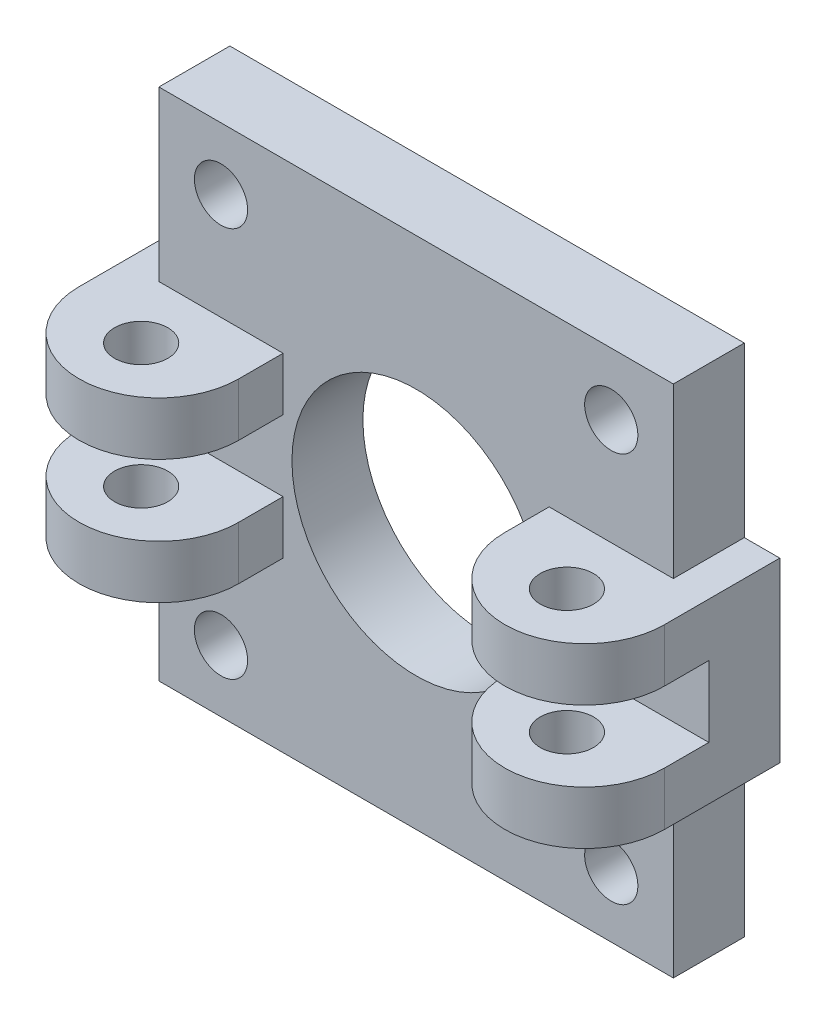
ISO-10303-21;
HEADER;
FILE_DESCRIPTION(('STEP AP214'),'2;1');
FILE_NAME('part.step','',(''),(''),'','','');
FILE_SCHEMA(('AUTOMOTIVE_DESIGN { 1 0 10303 214 1 1 1 1 }'));
ENDSEC;
DATA;
#1=APPLICATION_CONTEXT('core data for automotive mechanical design processes');
#2=APPLICATION_PROTOCOL_DEFINITION('international standard','automotive_design',2000,#1);
#3=PRODUCT_CONTEXT('',#1,'mechanical');
#4=PRODUCT('Part','Part','',(#3));
#5=PRODUCT_RELATED_PRODUCT_CATEGORY('part','',(#4));
#6=PRODUCT_DEFINITION_FORMATION('','',#4);
#7=PRODUCT_DEFINITION_CONTEXT('part definition',#1,'design');
#8=PRODUCT_DEFINITION('design','',#6,#7);
#9=PRODUCT_DEFINITION_SHAPE('','',#8);
#10=(LENGTH_UNIT() NAMED_UNIT(*) SI_UNIT(.MILLI.,.METRE.));
#11=(NAMED_UNIT(*) PLANE_ANGLE_UNIT() SI_UNIT($,.RADIAN.));
#12=(NAMED_UNIT(*) SI_UNIT($,.STERADIAN.) SOLID_ANGLE_UNIT());
#13=UNCERTAINTY_MEASURE_WITH_UNIT(LENGTH_MEASURE(1.E-05),#10,'distance_accuracy_value','');
#14=(GEOMETRIC_REPRESENTATION_CONTEXT(3) GLOBAL_UNCERTAINTY_ASSIGNED_CONTEXT((#13)) GLOBAL_UNIT_ASSIGNED_CONTEXT((#10,
#11,#12)) REPRESENTATION_CONTEXT('',''));
#15=CARTESIAN_POINT('',(0.,0.,0.));
#16=DIRECTION('',(0.,0.,1.));
#17=DIRECTION('',(1.,0.,0.));
#18=AXIS2_PLACEMENT_3D('',#15,#16,#17);
#19=CARTESIAN_POINT('',(-0.123161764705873,-0.224264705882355,-13.4536240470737));
#20=DIRECTION('',(1.,0.,0.));
#21=DIRECTION('',(0.,1.,0.));
#22=AXIS2_PLACEMENT_3D('',#19,#20,#21);
#23=PLANE('',#22);
#24=DIRECTION('',(0.,1.,0.));
#25=VECTOR('',#24,1.);
#26=CARTESIAN_POINT('',(-0.123161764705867,-16.5882257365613,6.5));
#27=LINE('',#26,#25);
#28=CARTESIAN_POINT('',(-0.123161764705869,-10.2242647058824,6.5));
#29=VERTEX_POINT('',#28);
#30=CARTESIAN_POINT('',(-0.123161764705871,-7.22426470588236,6.5));
#31=VERTEX_POINT('',#30);
#32=EDGE_CURVE('E287',#29,#31,#27,.T.);
#33=ORIENTED_EDGE('',*,*,#32,.T.);
#34=DIRECTION('',(0.,0.,1.));
#35=VECTOR('',#34,1.);
#36=CARTESIAN_POINT('',(-0.123161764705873,-7.22426470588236,4.));
#37=LINE('',#36,#35);
#38=CARTESIAN_POINT('',(-0.123161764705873,-7.22426470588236,4.));
#39=VERTEX_POINT('',#38);
#40=EDGE_CURVE('E491',#39,#31,#37,.T.);
#41=ORIENTED_EDGE('',*,*,#40,.F.);
#42=DIRECTION('',(0.,1.,0.));
#43=VECTOR('',#42,1.);
#44=CARTESIAN_POINT('',(-0.123161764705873,0.,4.));
#45=LINE('',#44,#43);
#46=CARTESIAN_POINT('',(-0.123161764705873,-10.2242647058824,4.));
#47=VERTEX_POINT('',#46);
#48=EDGE_CURVE('E307',#47,#39,#45,.T.);
#49=ORIENTED_EDGE('',*,*,#48,.F.);
#50=DIRECTION('',(0.,0.,1.));
#51=VECTOR('',#50,1.);
#52=CARTESIAN_POINT('',(-0.123161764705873,-10.2242647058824,-13.4536240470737));
#53=LINE('',#52,#51);
#54=EDGE_CURVE('E304',#47,#29,#53,.T.);
#55=ORIENTED_EDGE('',*,*,#54,.T.);
#56=EDGE_LOOP('',(#33,#41,#49,#55));
#57=FACE_BOUND('',#56,.T.);
#58=ADVANCED_FACE('F107',(#57),#23,.F.);
#59=CARTESIAN_POINT('',(-0.123161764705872,-3.22426470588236,6.5));
#60=VERTEX_POINT('',#59);
#61=CARTESIAN_POINT('',(-0.123161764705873,-0.224264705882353,6.5));
#62=VERTEX_POINT('',#61);
#63=EDGE_CURVE('E272',#60,#62,#27,.T.);
#64=ORIENTED_EDGE('',*,*,#63,.T.);
#65=DIRECTION('',(0.,0.,1.));
#66=VECTOR('',#65,1.);
#67=CARTESIAN_POINT('',(-0.123161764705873,-0.224264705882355,-13.4536240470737));
#68=LINE('',#67,#66);
#69=CARTESIAN_POINT('',(-0.123161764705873,-0.224264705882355,4.));
#70=VERTEX_POINT('',#69);
#71=EDGE_CURVE('E284',#70,#62,#68,.T.);
#72=ORIENTED_EDGE('',*,*,#71,.F.);
#73=CARTESIAN_POINT('',(-0.123161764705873,-3.22426470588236,4.));
#74=VERTEX_POINT('',#73);
#75=EDGE_CURVE('E129',#74,#70,#45,.T.);
#76=ORIENTED_EDGE('',*,*,#75,.F.);
#77=DIRECTION('',(0.,0.,1.));
#78=VECTOR('',#77,1.);
#79=CARTESIAN_POINT('',(-0.123161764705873,-3.22426470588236,4.));
#80=LINE('',#79,#78);
#81=EDGE_CURVE('E286',#74,#60,#80,.T.);
#82=ORIENTED_EDGE('',*,*,#81,.T.);
#83=EDGE_LOOP('',(#64,#72,#76,#82));
#84=FACE_BOUND('',#83,.T.);
#85=ADVANCED_FACE('F283',(#84),#23,.F.);
#86=CARTESIAN_POINT('',(8.87683823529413,-10.2242647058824,-13.4536240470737));
#87=DIRECTION('',(0.,1.,0.));
#88=DIRECTION('',(-1.,0.,0.));
#89=AXIS2_PLACEMENT_3D('',#86,#87,#88);
#90=PLANE('',#89);
#91=CARTESIAN_POINT('',(4.37683823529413,-10.2242647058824,7.5));
#92=DIRECTION('',(0.,-1.,0.));
#93=DIRECTION('',(1.,0.,0.));
#94=AXIS2_PLACEMENT_3D('',#91,#92,#93);
#95=CIRCLE('',#94,1.5);
#96=CARTESIAN_POINT('',(5.87683823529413,-10.2242647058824,7.5));
#97=VERTEX_POINT('',#96);
#98=EDGE_CURVE('E469',#97,#97,#95,.T.);
#99=ORIENTED_EDGE('',*,*,#98,.F.);
#100=EDGE_LOOP('',(#99));
#101=FACE_BOUND('',#100,.T.);
#102=CARTESIAN_POINT('',(4.37683823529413,-10.2242647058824,6.5));
#103=DIRECTION('',(0.,-1.,0.));
#104=DIRECTION('',(1.,0.,0.));
#105=AXIS2_PLACEMENT_3D('',#102,#103,#104);
#106=CIRCLE('',#105,4.5);
#107=CARTESIAN_POINT('',(8.87683823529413,-10.2242647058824,6.5));
#108=VERTEX_POINT('',#107);
#109=EDGE_CURVE('E570',#108,#29,#106,.T.);
#110=ORIENTED_EDGE('',*,*,#109,.T.);
#111=ORIENTED_EDGE('',*,*,#54,.F.);
#112=DIRECTION('',(-1.,0.,0.));
#113=VECTOR('',#112,1.);
#114=CARTESIAN_POINT('',(0.,-10.2242647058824,4.));
#115=LINE('',#114,#113);
#116=CARTESIAN_POINT('',(6.87683823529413,-10.2242647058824,4.));
#117=VERTEX_POINT('',#116);
#118=EDGE_CURVE('E314',#117,#47,#115,.T.);
#119=ORIENTED_EDGE('',*,*,#118,.F.);
#120=DIRECTION('',(0.,0.,1.));
#121=VECTOR('',#120,1.);
#122=CARTESIAN_POINT('',(6.87683823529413,-10.2242647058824,4.));
#123=LINE('',#122,#121);
#124=CARTESIAN_POINT('',(6.87683823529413,-10.2242647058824,0.));
#125=VERTEX_POINT('',#124);
#126=EDGE_CURVE('E317',#125,#117,#123,.T.);
#127=ORIENTED_EDGE('',*,*,#126,.F.);
#128=DIRECTION('',(1.,0.,0.));
#129=VECTOR('',#128,1.);
#130=CARTESIAN_POINT('',(8.87683823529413,-10.2242647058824,0.));
#131=LINE('',#130,#129);
#132=CARTESIAN_POINT('',(8.87683823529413,-10.2242647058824,0.));
#133=VERTEX_POINT('',#132);
#134=EDGE_CURVE('E291',#125,#133,#131,.T.);
#135=ORIENTED_EDGE('',*,*,#134,.T.);
#136=DIRECTION('',(0.,0.,1.));
#137=VECTOR('',#136,1.);
#138=CARTESIAN_POINT('',(8.87683823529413,-10.2242647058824,-13.4536240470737));
#139=LINE('',#138,#137);
#140=EDGE_CURVE('E296',#133,#108,#139,.T.);
#141=ORIENTED_EDGE('',*,*,#140,.T.);
#142=EDGE_LOOP('',(#110,#111,#119,#127,#135,#141));
#143=FACE_BOUND('',#142,.T.);
#144=ADVANCED_FACE('F567',(#101,#143),#90,.F.);
#145=CARTESIAN_POINT('',(8.87683823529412,-0.224264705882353,-13.4536240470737));
#146=DIRECTION('',(0.,-1.,0.));
#147=DIRECTION('',(1.,0.,0.));
#148=AXIS2_PLACEMENT_3D('',#145,#146,#147);
#149=PLANE('',#148);
#150=CARTESIAN_POINT('',(4.37683823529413,-0.224264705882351,7.5));
#151=DIRECTION('',(0.,-1.,0.));
#152=DIRECTION('',(1.,0.,0.));
#153=AXIS2_PLACEMENT_3D('',#150,#151,#152);
#154=CIRCLE('',#153,1.5);
#155=CARTESIAN_POINT('',(5.87683823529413,-0.22426470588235,7.5));
#156=VERTEX_POINT('',#155);
#157=EDGE_CURVE('E280',#156,#156,#154,.T.);
#158=ORIENTED_EDGE('',*,*,#157,.T.);
#159=EDGE_LOOP('',(#158));
#160=FACE_BOUND('',#159,.T.);
#161=ORIENTED_EDGE('',*,*,#71,.T.);
#162=CARTESIAN_POINT('',(4.37683823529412,-0.224264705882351,6.5));
#163=DIRECTION('',(0.,-1.,0.));
#164=DIRECTION('',(1.,0.,0.));
#165=AXIS2_PLACEMENT_3D('',#162,#163,#164);
#166=CIRCLE('',#165,4.5);
#167=CARTESIAN_POINT('',(8.87683823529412,-0.224264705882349,6.5));
#168=VERTEX_POINT('',#167);
#169=EDGE_CURVE('E269',#168,#62,#166,.T.);
#170=ORIENTED_EDGE('',*,*,#169,.F.);
#171=DIRECTION('',(0.,0.,1.));
#172=VECTOR('',#171,1.);
#173=CARTESIAN_POINT('',(8.87683823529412,-0.224264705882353,-13.4536240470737));
#174=LINE('',#173,#172);
#175=CARTESIAN_POINT('',(8.87683823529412,-0.224264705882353,0.));
#176=VERTEX_POINT('',#175);
#177=EDGE_CURVE('E292',#176,#168,#174,.T.);
#178=ORIENTED_EDGE('',*,*,#177,.F.);
#179=DIRECTION('',(-1.,0.,0.));
#180=VECTOR('',#179,1.);
#181=CARTESIAN_POINT('',(8.87683823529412,-0.224264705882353,0.));
#182=LINE('',#181,#180);
#183=CARTESIAN_POINT('',(6.87683823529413,-0.224264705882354,0.));
#184=VERTEX_POINT('',#183);
#185=EDGE_CURVE('E299',#176,#184,#182,.T.);
#186=ORIENTED_EDGE('',*,*,#185,.T.);
#187=DIRECTION('',(0.,0.,-1.));
#188=VECTOR('',#187,1.);
#189=CARTESIAN_POINT('',(6.87683823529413,-0.224264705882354,4.));
#190=LINE('',#189,#188);
#191=CARTESIAN_POINT('',(6.87683823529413,-0.224264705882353,4.));
#192=VERTEX_POINT('',#191);
#193=EDGE_CURVE('E311',#192,#184,#190,.T.);
#194=ORIENTED_EDGE('',*,*,#193,.F.);
#195=DIRECTION('',(1.,0.,0.));
#196=VECTOR('',#195,1.);
#197=CARTESIAN_POINT('',(0.,-0.224264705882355,4.));
#198=LINE('',#197,#196);
#199=EDGE_CURVE('E290',#70,#192,#198,.T.);
#200=ORIENTED_EDGE('',*,*,#199,.F.);
#201=EDGE_LOOP('',(#161,#170,#178,#186,#194,#200));
#202=FACE_BOUND('',#201,.T.);
#203=ADVANCED_FACE('F289',(#160,#202),#149,.F.);
#204=CARTESIAN_POINT('',(-15.2463235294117,-3.22426470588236,4.));
#205=DIRECTION('',(0.,1.,0.));
#206=DIRECTION('',(-1.,0.,0.));
#207=AXIS2_PLACEMENT_3D('',#204,#205,#206);
#208=PLANE('',#207);
#209=CARTESIAN_POINT('',(4.37683823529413,-3.22426470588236,7.5));
#210=DIRECTION('',(0.,1.,0.));
#211=DIRECTION('',(-1.,0.,0.));
#212=AXIS2_PLACEMENT_3D('',#209,#210,#211);
#213=CIRCLE('',#212,1.5);
#214=CARTESIAN_POINT('',(2.87683823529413,-3.22426470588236,7.5));
#215=VERTEX_POINT('',#214);
#216=EDGE_CURVE('E468',#215,#215,#213,.F.);
#217=ORIENTED_EDGE('',*,*,#216,.F.);
#218=EDGE_LOOP('',(#217));
#219=FACE_BOUND('',#218,.T.);
#220=CARTESIAN_POINT('',(4.37683823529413,-3.22426470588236,6.5));
#221=DIRECTION('',(0.,1.,0.));
#222=DIRECTION('',(-1.,0.,0.));
#223=AXIS2_PLACEMENT_3D('',#220,#221,#222);
#224=CIRCLE('',#223,4.5);
#225=CARTESIAN_POINT('',(8.87683823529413,-3.22426470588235,6.5));
#226=VERTEX_POINT('',#225);
#227=EDGE_CURVE('E473',#226,#60,#224,.F.);
#228=ORIENTED_EDGE('',*,*,#227,.T.);
#229=ORIENTED_EDGE('',*,*,#81,.F.);
#230=DIRECTION('',(-1.,0.,0.));
#231=VECTOR('',#230,1.);
#232=CARTESIAN_POINT('',(-15.2463235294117,-3.22426470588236,4.));
#233=LINE('',#232,#231);
#234=CARTESIAN_POINT('',(8.87683823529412,-3.22426470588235,4.));
#235=VERTEX_POINT('',#234);
#236=EDGE_CURVE('E489',#235,#74,#233,.T.);
#237=ORIENTED_EDGE('',*,*,#236,.F.);
#238=DIRECTION('',(0.,0.,1.));
#239=VECTOR('',#238,1.);
#240=CARTESIAN_POINT('',(8.87683823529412,-3.22426470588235,4.));
#241=LINE('',#240,#239);
#242=EDGE_CURVE('E493',#235,#226,#241,.T.);
#243=ORIENTED_EDGE('',*,*,#242,.T.);
#244=EDGE_LOOP('',(#228,#229,#237,#243));
#245=FACE_BOUND('',#244,.T.);
#246=ADVANCED_FACE('F582',(#219,#245),#208,.F.);
#247=CARTESIAN_POINT('',(-15.2463235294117,-7.22426470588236,4.));
#248=DIRECTION('',(0.,1.,0.));
#249=DIRECTION('',(-1.,0.,0.));
#250=AXIS2_PLACEMENT_3D('',#247,#248,#249);
#251=PLANE('',#250);
#252=ORIENTED_EDGE('',*,*,#40,.T.);
#253=CARTESIAN_POINT('',(4.37683823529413,-7.22426470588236,6.5));
#254=DIRECTION('',(0.,1.,0.));
#255=DIRECTION('',(-1.,0.,0.));
#256=AXIS2_PLACEMENT_3D('',#253,#254,#255);
#257=CIRCLE('',#256,4.5);
#258=CARTESIAN_POINT('',(8.87683823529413,-7.22426470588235,6.5));
#259=VERTEX_POINT('',#258);
#260=EDGE_CURVE('E12',#259,#31,#257,.F.);
#261=ORIENTED_EDGE('',*,*,#260,.F.);
#262=DIRECTION('',(0.,0.,1.));
#263=VECTOR('',#262,1.);
#264=CARTESIAN_POINT('',(8.87683823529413,-7.22426470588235,4.));
#265=LINE('',#264,#263);
#266=CARTESIAN_POINT('',(8.87683823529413,-7.22426470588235,4.));
#267=VERTEX_POINT('',#266);
#268=EDGE_CURVE('E496',#267,#259,#265,.T.);
#269=ORIENTED_EDGE('',*,*,#268,.F.);
#270=DIRECTION('',(-1.,0.,0.));
#271=VECTOR('',#270,1.);
#272=CARTESIAN_POINT('',(-15.2463235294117,-7.22426470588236,4.));
#273=LINE('',#272,#271);
#274=EDGE_CURVE('E484',#267,#39,#273,.T.);
#275=ORIENTED_EDGE('',*,*,#274,.T.);
#276=EDGE_LOOP('',(#252,#261,#269,#275));
#277=FACE_BOUND('',#276,.T.);
#278=CARTESIAN_POINT('',(4.37683823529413,-7.22426470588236,7.5));
#279=DIRECTION('',(0.,1.,0.));
#280=DIRECTION('',(-1.,0.,0.));
#281=AXIS2_PLACEMENT_3D('',#278,#279,#280);
#282=CIRCLE('',#281,1.5);
#283=CARTESIAN_POINT('',(2.87683823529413,-7.22426470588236,7.5));
#284=VERTEX_POINT('',#283);
#285=EDGE_CURVE('E466',#284,#284,#282,.F.);
#286=ORIENTED_EDGE('',*,*,#285,.T.);
#287=EDGE_LOOP('',(#286));
#288=FACE_BOUND('',#287,.T.);
#289=ADVANCED_FACE('F584',(#277,#288),#251,.T.);
#290=CARTESIAN_POINT('',(6.87683823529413,0.,4.));
#291=DIRECTION('',(1.,0.,0.));
#292=DIRECTION('',(0.,1.,0.));
#293=AXIS2_PLACEMENT_3D('',#290,#291,#292);
#294=PLANE('',#293);
#295=DIRECTION('',(0.,-1.,0.));
#296=VECTOR('',#295,1.);
#297=CARTESIAN_POINT('',(6.87683823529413,0.,0.));
#298=LINE('',#297,#296);
#299=CARTESIAN_POINT('',(6.87683823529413,-19.7242647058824,0.));
#300=VERTEX_POINT('',#299);
#301=EDGE_CURVE('E431',#125,#300,#298,.T.);
#302=ORIENTED_EDGE('',*,*,#301,.F.);
#303=ORIENTED_EDGE('',*,*,#126,.T.);
#304=DIRECTION('',(0.,-1.,0.));
#305=VECTOR('',#304,1.);
#306=CARTESIAN_POINT('',(6.87683823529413,0.,4.));
#307=LINE('',#306,#305);
#308=CARTESIAN_POINT('',(6.87683823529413,-19.7242647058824,4.));
#309=VERTEX_POINT('',#308);
#310=EDGE_CURVE('E414',#117,#309,#307,.T.);
#311=ORIENTED_EDGE('',*,*,#310,.T.);
#312=DIRECTION('',(0.,0.,-1.));
#313=VECTOR('',#312,1.);
#314=CARTESIAN_POINT('',(6.87683823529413,-19.7242647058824,4.));
#315=LINE('',#314,#313);
#316=EDGE_CURVE('E426',#309,#300,#315,.T.);
#317=ORIENTED_EDGE('',*,*,#316,.T.);
#318=EDGE_LOOP('',(#302,#303,#311,#317));
#319=FACE_BOUND('',#318,.T.);
#320=ADVANCED_FACE('F109',(#319),#294,.T.);
#321=CARTESIAN_POINT('',(6.87683823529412,9.27573529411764,4.));
#322=VERTEX_POINT('',#321);
#323=EDGE_CURVE('E410',#322,#192,#307,.T.);
#324=ORIENTED_EDGE('',*,*,#323,.T.);
#325=ORIENTED_EDGE('',*,*,#193,.T.);
#326=CARTESIAN_POINT('',(6.87683823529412,9.27573529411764,0.));
#327=VERTEX_POINT('',#326);
#328=EDGE_CURVE('E427',#327,#184,#298,.T.);
#329=ORIENTED_EDGE('',*,*,#328,.F.);
#330=DIRECTION('',(0.,0.,-1.));
#331=VECTOR('',#330,1.);
#332=CARTESIAN_POINT('',(6.87683823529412,9.27573529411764,4.));
#333=LINE('',#332,#331);
#334=EDGE_CURVE('E450',#322,#327,#333,.T.);
#335=ORIENTED_EDGE('',*,*,#334,.F.);
#336=EDGE_LOOP('',(#324,#325,#329,#335));
#337=FACE_BOUND('',#336,.T.);
#338=ADVANCED_FACE('F507',(#337),#294,.T.);
#339=CARTESIAN_POINT('',(0.,0.,4.));
#340=DIRECTION('',(0.,0.,1.));
#341=DIRECTION('',(1.,0.,0.));
#342=AXIS2_PLACEMENT_3D('',#339,#340,#341);
#343=PLANE('',#342);
#344=CARTESIAN_POINT('',(-18.6231617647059,-16.2242647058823,4.));
#345=DIRECTION('',(0.,0.,1.));
#346=DIRECTION('',(1.,0.,0.));
#347=AXIS2_PLACEMENT_3D('',#344,#345,#346);
#348=CIRCLE('',#347,1.5);
#349=CARTESIAN_POINT('',(-17.1231617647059,-16.2242647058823,4.));
#350=VERTEX_POINT('',#349);
#351=EDGE_CURVE('E397',#350,#350,#348,.T.);
#352=ORIENTED_EDGE('',*,*,#351,.F.);
#353=EDGE_LOOP('',(#352));
#354=FACE_BOUND('',#353,.T.);
#355=CARTESIAN_POINT('',(3.37683823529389,-16.2242647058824,4.));
#356=DIRECTION('',(0.,0.,1.));
#357=DIRECTION('',(1.,0.,0.));
#358=AXIS2_PLACEMENT_3D('',#355,#356,#357);
#359=CIRCLE('',#358,1.5);
#360=CARTESIAN_POINT('',(4.87683823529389,-16.2242647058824,4.));
#361=VERTEX_POINT('',#360);
#362=EDGE_CURVE('E402',#361,#361,#359,.T.);
#363=ORIENTED_EDGE('',*,*,#362,.F.);
#364=EDGE_LOOP('',(#363));
#365=FACE_BOUND('',#364,.T.);
#366=CARTESIAN_POINT('',(3.376838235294,5.77573529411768,4.));
#367=DIRECTION('',(0.,0.,1.));
#368=DIRECTION('',(1.,0.,0.));
#369=AXIS2_PLACEMENT_3D('',#366,#367,#368);
#370=CIRCLE('',#369,1.5);
#371=CARTESIAN_POINT('',(4.876838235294,5.77573529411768,4.));
#372=VERTEX_POINT('',#371);
#373=EDGE_CURVE('E398',#372,#372,#370,.T.);
#374=ORIENTED_EDGE('',*,*,#373,.F.);
#375=EDGE_LOOP('',(#374));
#376=FACE_BOUND('',#375,.T.);
#377=CARTESIAN_POINT('',(-18.6231617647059,5.77573529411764,4.));
#378=DIRECTION('',(0.,0.,1.));
#379=DIRECTION('',(1.,0.,0.));
#380=AXIS2_PLACEMENT_3D('',#377,#378,#379);
#381=CIRCLE('',#380,1.5);
#382=CARTESIAN_POINT('',(-17.1231617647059,5.77573529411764,4.));
#383=VERTEX_POINT('',#382);
#384=EDGE_CURVE('E401',#383,#383,#381,.T.);
#385=ORIENTED_EDGE('',*,*,#384,.F.);
#386=EDGE_LOOP('',(#385));
#387=FACE_BOUND('',#386,.T.);
#388=CARTESIAN_POINT('',(-7.62316176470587,-5.22426470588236,4.));
#389=DIRECTION('',(0.,0.,1.));
#390=DIRECTION('',(1.,0.,0.));
#391=AXIS2_PLACEMENT_3D('',#388,#389,#390);
#392=CIRCLE('',#391,7.);
#393=CARTESIAN_POINT('',(-0.623161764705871,-5.22426470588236,4.));
#394=VERTEX_POINT('',#393);
#395=EDGE_CURVE('E423',#394,#394,#392,.T.);
#396=ORIENTED_EDGE('',*,*,#395,.F.);
#397=EDGE_LOOP('',(#396));
#398=FACE_BOUND('',#397,.T.);
#399=ORIENTED_EDGE('',*,*,#310,.F.);
#400=ORIENTED_EDGE('',*,*,#118,.T.);
#401=ORIENTED_EDGE('',*,*,#48,.T.);
#402=ORIENTED_EDGE('',*,*,#274,.F.);
#403=DIRECTION('',(0.,-1.,0.));
#404=VECTOR('',#403,1.);
#405=CARTESIAN_POINT('',(8.87683823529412,0.,4.));
#406=LINE('',#405,#404);
#407=EDGE_CURVE('E486',#235,#267,#406,.T.);
#408=ORIENTED_EDGE('',*,*,#407,.F.);
#409=ORIENTED_EDGE('',*,*,#236,.T.);
#410=ORIENTED_EDGE('',*,*,#75,.T.);
#411=ORIENTED_EDGE('',*,*,#199,.T.);
#412=ORIENTED_EDGE('',*,*,#323,.F.);
#413=DIRECTION('',(1.,0.,0.));
#414=VECTOR('',#413,1.);
#415=CARTESIAN_POINT('',(0.,9.27573529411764,4.));
#416=LINE('',#415,#414);
#417=CARTESIAN_POINT('',(-22.1231617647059,9.27573529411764,4.));
#418=VERTEX_POINT('',#417);
#419=EDGE_CURVE('E413',#418,#322,#416,.T.);
#420=ORIENTED_EDGE('',*,*,#419,.F.);
#421=DIRECTION('',(0.,-1.,0.));
#422=VECTOR('',#421,1.);
#423=CARTESIAN_POINT('',(-22.1231617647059,0.,4.));
#424=LINE('',#423,#422);
#425=CARTESIAN_POINT('',(-22.1231617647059,-0.224264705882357,4.));
#426=VERTEX_POINT('',#425);
#427=EDGE_CURVE('E418',#418,#426,#424,.T.);
#428=ORIENTED_EDGE('',*,*,#427,.T.);
#429=DIRECTION('',(-1.,0.,0.));
#430=VECTOR('',#429,1.);
#431=CARTESIAN_POINT('',(0.,-0.224264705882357,4.));
#432=LINE('',#431,#430);
#433=CARTESIAN_POINT('',(-15.1231617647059,-0.224264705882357,4.));
#434=VERTEX_POINT('',#433);
#435=EDGE_CURVE('E382',#434,#426,#432,.T.);
#436=ORIENTED_EDGE('',*,*,#435,.F.);
#437=DIRECTION('',(0.,1.,0.));
#438=VECTOR('',#437,1.);
#439=CARTESIAN_POINT('',(-15.1231617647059,0.,4.));
#440=LINE('',#439,#438);
#441=CARTESIAN_POINT('',(-15.1231617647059,-3.22426470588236,4.));
#442=VERTEX_POINT('',#441);
#443=EDGE_CURVE('E393',#442,#434,#440,.T.);
#444=ORIENTED_EDGE('',*,*,#443,.F.);
#445=DIRECTION('',(1.,0.,0.));
#446=VECTOR('',#445,1.);
#447=CARTESIAN_POINT('',(0.,-3.22426470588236,4.));
#448=LINE('',#447,#446);
#449=CARTESIAN_POINT('',(-24.1231617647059,-3.22426470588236,4.));
#450=VERTEX_POINT('',#449);
#451=EDGE_CURVE('E344',#450,#442,#448,.T.);
#452=ORIENTED_EDGE('',*,*,#451,.F.);
#453=DIRECTION('',(0.,-1.,0.));
#454=VECTOR('',#453,1.);
#455=CARTESIAN_POINT('',(-24.1231617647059,0.,4.));
#456=LINE('',#455,#454);
#457=CARTESIAN_POINT('',(-24.1231617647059,-7.22426470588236,4.));
#458=VERTEX_POINT('',#457);
#459=EDGE_CURVE('E346',#450,#458,#456,.T.);
#460=ORIENTED_EDGE('',*,*,#459,.T.);
#461=DIRECTION('',(1.,0.,0.));
#462=VECTOR('',#461,1.);
#463=CARTESIAN_POINT('',(0.,-7.22426470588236,4.));
#464=LINE('',#463,#462);
#465=CARTESIAN_POINT('',(-15.1231617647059,-7.22426470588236,4.));
#466=VERTEX_POINT('',#465);
#467=EDGE_CURVE('E348',#458,#466,#464,.T.);
#468=ORIENTED_EDGE('',*,*,#467,.T.);
#469=CARTESIAN_POINT('',(-15.1231617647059,-10.2242647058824,4.));
#470=VERTEX_POINT('',#469);
#471=EDGE_CURVE('E394',#470,#466,#440,.T.);
#472=ORIENTED_EDGE('',*,*,#471,.F.);
#473=DIRECTION('',(1.,0.,0.));
#474=VECTOR('',#473,1.);
#475=CARTESIAN_POINT('',(0.,-10.2242647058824,4.));
#476=LINE('',#475,#474);
#477=CARTESIAN_POINT('',(-22.1231617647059,-10.2242647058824,4.));
#478=VERTEX_POINT('',#477);
#479=EDGE_CURVE('E388',#478,#470,#476,.T.);
#480=ORIENTED_EDGE('',*,*,#479,.F.);
#481=CARTESIAN_POINT('',(-22.1231617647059,-19.7242647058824,4.));
#482=VERTEX_POINT('',#481);
#483=EDGE_CURVE('E417',#478,#482,#424,.T.);
#484=ORIENTED_EDGE('',*,*,#483,.T.);
#485=DIRECTION('',(1.,0.,0.));
#486=VECTOR('',#485,1.);
#487=CARTESIAN_POINT('',(0.,-19.7242647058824,4.));
#488=LINE('',#487,#486);
#489=EDGE_CURVE('E420',#482,#309,#488,.T.);
#490=ORIENTED_EDGE('',*,*,#489,.T.);
#491=EDGE_LOOP('',(#399,#400,#401,#402,#408,#409,#410,#411,#412,#420,#428,#436,#444,#452,#460,
#468,#472,#480,#484,#490));
#492=FACE_BOUND('',#491,.T.);
#493=ADVANCED_FACE('F518',(#354,#365,#376,#387,#398,#492),#343,.T.);
#494=CARTESIAN_POINT('',(-24.1231617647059,-10.2242647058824,-13.4536240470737));
#495=DIRECTION('',(0.,-1.,0.));
#496=DIRECTION('',(0.,0.,-1.));
#497=AXIS2_PLACEMENT_3D('',#494,#495,#496);
#498=PLANE('',#497);
#499=CARTESIAN_POINT('',(-19.6231617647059,-10.2242647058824,7.5));
#500=DIRECTION('',(0.,-1.,0.));
#501=DIRECTION('',(0.,0.,-1.));
#502=AXIS2_PLACEMENT_3D('',#499,#500,#501);
#503=CIRCLE('',#502,1.5);
#504=CARTESIAN_POINT('',(-19.6231617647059,-10.2242647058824,6.));
#505=VERTEX_POINT('',#504);
#506=EDGE_CURVE('E335',#505,#505,#503,.F.);
#507=ORIENTED_EDGE('',*,*,#506,.T.);
#508=EDGE_LOOP('',(#507));
#509=FACE_BOUND('',#508,.T.);
#510=DIRECTION('',(0.,0.,1.));
#511=VECTOR('',#510,1.);
#512=CARTESIAN_POINT('',(-15.1231617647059,-10.2242647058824,-13.4536240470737));
#513=LINE('',#512,#511);
#514=CARTESIAN_POINT('',(-15.1231617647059,-10.2242647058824,6.5));
#515=VERTEX_POINT('',#514);
#516=EDGE_CURVE('E367',#470,#515,#513,.T.);
#517=ORIENTED_EDGE('',*,*,#516,.T.);
#518=CARTESIAN_POINT('',(-19.6231617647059,-10.2242647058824,6.5));
#519=DIRECTION('',(0.,-1.,0.));
#520=DIRECTION('',(0.,0.,-1.));
#521=AXIS2_PLACEMENT_3D('',#518,#519,#520);
#522=CIRCLE('',#521,4.5);
#523=CARTESIAN_POINT('',(-24.1231617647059,-10.2242647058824,6.5));
#524=VERTEX_POINT('',#523);
#525=EDGE_CURVE('E324',#524,#515,#522,.F.);
#526=ORIENTED_EDGE('',*,*,#525,.F.);
#527=DIRECTION('',(0.,0.,1.));
#528=VECTOR('',#527,1.);
#529=CARTESIAN_POINT('',(-24.1231617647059,-10.2242647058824,-13.4536240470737));
#530=LINE('',#529,#528);
#531=CARTESIAN_POINT('',(-24.1231617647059,-10.2242647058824,0.));
#532=VERTEX_POINT('',#531);
#533=EDGE_CURVE('E372',#532,#524,#530,.T.);
#534=ORIENTED_EDGE('',*,*,#533,.F.);
#535=DIRECTION('',(-1.,0.,0.));
#536=VECTOR('',#535,1.);
#537=CARTESIAN_POINT('',(-24.1231617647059,-10.2242647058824,0.));
#538=LINE('',#537,#536);
#539=CARTESIAN_POINT('',(-22.1231617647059,-10.2242647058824,0.));
#540=VERTEX_POINT('',#539);
#541=EDGE_CURVE('E366',#540,#532,#538,.T.);
#542=ORIENTED_EDGE('',*,*,#541,.F.);
#543=DIRECTION('',(0.,0.,-1.));
#544=VECTOR('',#543,1.);
#545=CARTESIAN_POINT('',(-22.1231617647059,-10.2242647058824,4.));
#546=LINE('',#545,#544);
#547=EDGE_CURVE('E391',#478,#540,#546,.T.);
#548=ORIENTED_EDGE('',*,*,#547,.F.);
#549=ORIENTED_EDGE('',*,*,#479,.T.);
#550=EDGE_LOOP('',(#517,#526,#534,#542,#548,#549));
#551=FACE_BOUND('',#550,.T.);
#552=ADVANCED_FACE('F549',(#509,#551),#498,.T.);
#553=CARTESIAN_POINT('',(-24.1231617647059,-0.224264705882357,-13.4536240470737));
#554=DIRECTION('',(0.,1.,0.));
#555=DIRECTION('',(0.,0.,1.));
#556=AXIS2_PLACEMENT_3D('',#553,#554,#555);
#557=PLANE('',#556);
#558=CARTESIAN_POINT('',(-19.6231617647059,-0.224264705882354,7.5));
#559=DIRECTION('',(0.,1.,0.));
#560=DIRECTION('',(-1.,0.,0.));
#561=AXIS2_PLACEMENT_3D('',#558,#559,#560);
#562=CIRCLE('',#561,1.5);
#563=CARTESIAN_POINT('',(-21.1231617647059,-0.224264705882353,7.5));
#564=VERTEX_POINT('',#563);
#565=EDGE_CURVE('E327',#564,#564,#562,.T.);
#566=ORIENTED_EDGE('',*,*,#565,.F.);
#567=EDGE_LOOP('',(#566));
#568=FACE_BOUND('',#567,.T.);
#569=CARTESIAN_POINT('',(-19.6231617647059,-0.224264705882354,6.5));
#570=DIRECTION('',(0.,1.,0.));
#571=DIRECTION('',(-1.,0.,0.));
#572=AXIS2_PLACEMENT_3D('',#569,#570,#571);
#573=CIRCLE('',#572,4.5);
#574=CARTESIAN_POINT('',(-24.1231617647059,-0.224264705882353,6.5));
#575=VERTEX_POINT('',#574);
#576=CARTESIAN_POINT('',(-15.1231617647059,-0.224264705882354,6.5));
#577=VERTEX_POINT('',#576);
#578=EDGE_CURVE('E325',#575,#577,#573,.T.);
#579=ORIENTED_EDGE('',*,*,#578,.T.);
#580=DIRECTION('',(0.,0.,1.));
#581=VECTOR('',#580,1.);
#582=CARTESIAN_POINT('',(-15.1231617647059,-0.224264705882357,-13.4536240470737));
#583=LINE('',#582,#581);
#584=EDGE_CURVE('E355',#434,#577,#583,.T.);
#585=ORIENTED_EDGE('',*,*,#584,.F.);
#586=ORIENTED_EDGE('',*,*,#435,.T.);
#587=DIRECTION('',(0.,0.,1.));
#588=VECTOR('',#587,1.);
#589=CARTESIAN_POINT('',(-22.1231617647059,-0.224264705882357,4.));
#590=LINE('',#589,#588);
#591=CARTESIAN_POINT('',(-22.1231617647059,-0.224264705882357,0.));
#592=VERTEX_POINT('',#591);
#593=EDGE_CURVE('E385',#592,#426,#590,.T.);
#594=ORIENTED_EDGE('',*,*,#593,.F.);
#595=DIRECTION('',(1.,0.,0.));
#596=VECTOR('',#595,1.);
#597=CARTESIAN_POINT('',(-24.1231617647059,-0.224264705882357,0.));
#598=LINE('',#597,#596);
#599=CARTESIAN_POINT('',(-24.1231617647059,-0.224264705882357,0.));
#600=VERTEX_POINT('',#599);
#601=EDGE_CURVE('E369',#600,#592,#598,.T.);
#602=ORIENTED_EDGE('',*,*,#601,.F.);
#603=DIRECTION('',(0.,0.,1.));
#604=VECTOR('',#603,1.);
#605=CARTESIAN_POINT('',(-24.1231617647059,-0.224264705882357,-13.4536240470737));
#606=LINE('',#605,#604);
#607=EDGE_CURVE('E375',#600,#575,#606,.T.);
#608=ORIENTED_EDGE('',*,*,#607,.T.);
#609=EDGE_LOOP('',(#579,#585,#586,#594,#602,#608));
#610=FACE_BOUND('',#609,.T.);
#611=ADVANCED_FACE('F527',(#568,#610),#557,.T.);
#612=CARTESIAN_POINT('',(0.,-7.22426470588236,4.));
#613=DIRECTION('',(0.,-1.,0.));
#614=DIRECTION('',(0.,0.,-1.));
#615=AXIS2_PLACEMENT_3D('',#612,#613,#614);
#616=PLANE('',#615);
#617=CARTESIAN_POINT('',(-19.6231617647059,-7.22426470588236,7.5));
#618=DIRECTION('',(0.,-1.,0.));
#619=DIRECTION('',(0.,0.,-1.));
#620=AXIS2_PLACEMENT_3D('',#617,#618,#619);
#621=CIRCLE('',#620,1.5);
#622=CARTESIAN_POINT('',(-19.6231617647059,-7.22426470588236,6.));
#623=VERTEX_POINT('',#622);
#624=EDGE_CURVE('E339',#623,#623,#621,.T.);
#625=ORIENTED_EDGE('',*,*,#624,.T.);
#626=EDGE_LOOP('',(#625));
#627=FACE_BOUND('',#626,.T.);
#628=CARTESIAN_POINT('',(-19.6231617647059,-7.22426470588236,6.5));
#629=DIRECTION('',(0.,-1.,0.));
#630=DIRECTION('',(0.,0.,-1.));
#631=AXIS2_PLACEMENT_3D('',#628,#629,#630);
#632=CIRCLE('',#631,4.5);
#633=CARTESIAN_POINT('',(-15.1231617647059,-7.22426470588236,6.5));
#634=VERTEX_POINT('',#633);
#635=CARTESIAN_POINT('',(-24.1231617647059,-7.22426470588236,6.5));
#636=VERTEX_POINT('',#635);
#637=EDGE_CURVE('E342',#634,#636,#632,.T.);
#638=ORIENTED_EDGE('',*,*,#637,.F.);
#639=DIRECTION('',(0.,0.,1.));
#640=VECTOR('',#639,1.);
#641=CARTESIAN_POINT('',(-15.1231617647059,-7.22426470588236,4.));
#642=LINE('',#641,#640);
#643=EDGE_CURVE('E352',#466,#634,#642,.T.);
#644=ORIENTED_EDGE('',*,*,#643,.F.);
#645=ORIENTED_EDGE('',*,*,#467,.F.);
#646=DIRECTION('',(0.,0.,1.));
#647=VECTOR('',#646,1.);
#648=CARTESIAN_POINT('',(-24.1231617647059,-7.22426470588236,4.));
#649=LINE('',#648,#647);
#650=EDGE_CURVE('E356',#458,#636,#649,.T.);
#651=ORIENTED_EDGE('',*,*,#650,.T.);
#652=EDGE_LOOP('',(#638,#644,#645,#651));
#653=FACE_BOUND('',#652,.T.);
#654=ADVANCED_FACE('F542',(#627,#653),#616,.F.);
#655=CARTESIAN_POINT('',(0.,-3.22426470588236,4.));
#656=DIRECTION('',(0.,-1.,0.));
#657=DIRECTION('',(0.,0.,-1.));
#658=AXIS2_PLACEMENT_3D('',#655,#656,#657);
#659=PLANE('',#658);
#660=CARTESIAN_POINT('',(-19.6231617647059,-3.22426470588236,7.5));
#661=DIRECTION('',(0.,-1.,0.));
#662=DIRECTION('',(0.,0.,-1.));
#663=AXIS2_PLACEMENT_3D('',#660,#661,#662);
#664=CIRCLE('',#663,1.5);
#665=CARTESIAN_POINT('',(-19.6231617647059,-3.22426470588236,6.));
#666=VERTEX_POINT('',#665);
#667=EDGE_CURVE('E338',#666,#666,#664,.T.);
#668=ORIENTED_EDGE('',*,*,#667,.F.);
#669=EDGE_LOOP('',(#668));
#670=FACE_BOUND('',#669,.T.);
#671=DIRECTION('',(0.,0.,1.));
#672=VECTOR('',#671,1.);
#673=CARTESIAN_POINT('',(-15.1231617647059,-3.22426470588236,4.));
#674=LINE('',#673,#672);
#675=CARTESIAN_POINT('',(-15.1231617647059,-3.22426470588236,6.5));
#676=VERTEX_POINT('',#675);
#677=EDGE_CURVE('E351',#442,#676,#674,.T.);
#678=ORIENTED_EDGE('',*,*,#677,.T.);
#679=CARTESIAN_POINT('',(-19.6231617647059,-3.22426470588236,6.5));
#680=DIRECTION('',(0.,-1.,0.));
#681=DIRECTION('',(0.,0.,-1.));
#682=AXIS2_PLACEMENT_3D('',#679,#680,#681);
#683=CIRCLE('',#682,4.5);
#684=CARTESIAN_POINT('',(-24.1231617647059,-3.22426470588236,6.5));
#685=VERTEX_POINT('',#684);
#686=EDGE_CURVE('E115',#676,#685,#683,.T.);
#687=ORIENTED_EDGE('',*,*,#686,.T.);
#688=DIRECTION('',(0.,0.,1.));
#689=VECTOR('',#688,1.);
#690=CARTESIAN_POINT('',(-24.1231617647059,-3.22426470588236,4.));
#691=LINE('',#690,#689);
#692=EDGE_CURVE('E359',#450,#685,#691,.T.);
#693=ORIENTED_EDGE('',*,*,#692,.F.);
#694=ORIENTED_EDGE('',*,*,#451,.T.);
#695=EDGE_LOOP('',(#678,#687,#693,#694));
#696=FACE_BOUND('',#695,.T.);
#697=ADVANCED_FACE('F617',(#670,#696),#659,.T.);
#698=CARTESIAN_POINT('',(-24.1231617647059,-0.224264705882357,-13.4536240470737));
#699=DIRECTION('',(-1.,0.,0.));
#700=DIRECTION('',(0.,-1.,0.));
#701=AXIS2_PLACEMENT_3D('',#698,#699,#700);
#702=PLANE('',#701);
#703=ORIENTED_EDGE('',*,*,#533,.T.);
#704=DIRECTION('',(0.,1.,0.));
#705=VECTOR('',#704,1.);
#706=CARTESIAN_POINT('',(-24.1231617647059,-16.5882257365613,6.5));
#707=LINE('',#706,#705);
#708=EDGE_CURVE('E328',#524,#636,#707,.T.);
#709=ORIENTED_EDGE('',*,*,#708,.T.);
#710=ORIENTED_EDGE('',*,*,#650,.F.);
#711=ORIENTED_EDGE('',*,*,#459,.F.);
#712=ORIENTED_EDGE('',*,*,#692,.T.);
#713=EDGE_CURVE('E330',#685,#575,#707,.T.);
#714=ORIENTED_EDGE('',*,*,#713,.T.);
#715=ORIENTED_EDGE('',*,*,#607,.F.);
#716=DIRECTION('',(0.,1.,0.));
#717=VECTOR('',#716,1.);
#718=CARTESIAN_POINT('',(-24.1231617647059,-0.224264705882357,0.));
#719=LINE('',#718,#717);
#720=EDGE_CURVE('E364',#532,#600,#719,.T.);
#721=ORIENTED_EDGE('',*,*,#720,.F.);
#722=EDGE_LOOP('',(#703,#709,#710,#711,#712,#714,#715,#721));
#723=FACE_BOUND('',#722,.T.);
#724=ADVANCED_FACE('F539',(#723),#702,.T.);
#725=CARTESIAN_POINT('',(-15.1231617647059,-0.224264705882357,-13.4536240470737));
#726=DIRECTION('',(1.,0.,0.));
#727=DIRECTION('',(0.,1.,0.));
#728=AXIS2_PLACEMENT_3D('',#725,#726,#727);
#729=PLANE('',#728);
#730=DIRECTION('',(0.,1.,0.));
#731=VECTOR('',#730,1.);
#732=CARTESIAN_POINT('',(-15.1231617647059,-16.5882257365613,6.5));
#733=LINE('',#732,#731);
#734=EDGE_CURVE('E320',#676,#577,#733,.T.);
#735=ORIENTED_EDGE('',*,*,#734,.F.);
#736=ORIENTED_EDGE('',*,*,#677,.F.);
#737=ORIENTED_EDGE('',*,*,#443,.T.);
#738=ORIENTED_EDGE('',*,*,#584,.T.);
#739=EDGE_LOOP('',(#735,#736,#737,#738));
#740=FACE_BOUND('',#739,.T.);
#741=ADVANCED_FACE('F531',(#740),#729,.T.);
#742=CARTESIAN_POINT('',(-22.1231617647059,0.,4.));
#743=DIRECTION('',(1.,0.,0.));
#744=DIRECTION('',(0.,1.,0.));
#745=AXIS2_PLACEMENT_3D('',#742,#743,#744);
#746=PLANE('',#745);
#747=ORIENTED_EDGE('',*,*,#483,.F.);
#748=ORIENTED_EDGE('',*,*,#547,.T.);
#749=DIRECTION('',(0.,-1.,0.));
#750=VECTOR('',#749,1.);
#751=CARTESIAN_POINT('',(-22.1231617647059,0.,0.));
#752=LINE('',#751,#750);
#753=CARTESIAN_POINT('',(-22.1231617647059,-19.7242647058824,0.));
#754=VERTEX_POINT('',#753);
#755=EDGE_CURVE('E434',#540,#754,#752,.T.);
#756=ORIENTED_EDGE('',*,*,#755,.T.);
#757=DIRECTION('',(0.,0.,-1.));
#758=VECTOR('',#757,1.);
#759=CARTESIAN_POINT('',(-22.1231617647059,-19.7242647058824,4.));
#760=LINE('',#759,#758);
#761=EDGE_CURVE('E445',#482,#754,#760,.T.);
#762=ORIENTED_EDGE('',*,*,#761,.F.);
#763=EDGE_LOOP('',(#747,#748,#756,#762));
#764=FACE_BOUND('',#763,.T.);
#765=ADVANCED_FACE('F556',(#764),#746,.F.);
#766=CARTESIAN_POINT('',(0.,9.27573529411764,4.));
#767=DIRECTION('',(0.,1.,0.));
#768=DIRECTION('',(0.,0.,1.));
#769=AXIS2_PLACEMENT_3D('',#766,#767,#768);
#770=PLANE('',#769);
#771=DIRECTION('',(1.,0.,0.));
#772=VECTOR('',#771,1.);
#773=CARTESIAN_POINT('',(0.,9.27573529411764,0.));
#774=LINE('',#773,#772);
#775=CARTESIAN_POINT('',(-22.1231617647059,9.27573529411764,0.));
#776=VERTEX_POINT('',#775);
#777=EDGE_CURVE('E430',#776,#327,#774,.T.);
#778=ORIENTED_EDGE('',*,*,#777,.F.);
#779=DIRECTION('',(0.,0.,-1.));
#780=VECTOR('',#779,1.);
#781=CARTESIAN_POINT('',(-22.1231617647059,9.27573529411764,4.));
#782=LINE('',#781,#780);
#783=EDGE_CURVE('E448',#418,#776,#782,.T.);
#784=ORIENTED_EDGE('',*,*,#783,.F.);
#785=ORIENTED_EDGE('',*,*,#419,.T.);
#786=ORIENTED_EDGE('',*,*,#334,.T.);
#787=EDGE_LOOP('',(#778,#784,#785,#786));
#788=FACE_BOUND('',#787,.T.);
#789=ADVANCED_FACE('F514',(#788),#770,.T.);
#790=EDGE_CURVE('E435',#776,#592,#752,.T.);
#791=ORIENTED_EDGE('',*,*,#790,.T.);
#792=ORIENTED_EDGE('',*,*,#593,.T.);
#793=ORIENTED_EDGE('',*,*,#427,.F.);
#794=ORIENTED_EDGE('',*,*,#783,.T.);
#795=EDGE_LOOP('',(#791,#792,#793,#794));
#796=FACE_BOUND('',#795,.T.);
#797=ADVANCED_FACE('F524',(#796),#746,.F.);
#798=CARTESIAN_POINT('',(0.,-19.7242647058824,4.));
#799=DIRECTION('',(0.,1.,0.));
#800=DIRECTION('',(0.,0.,1.));
#801=AXIS2_PLACEMENT_3D('',#798,#799,#800);
#802=PLANE('',#801);
#803=DIRECTION('',(1.,0.,0.));
#804=VECTOR('',#803,1.);
#805=CARTESIAN_POINT('',(0.,-19.7242647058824,0.));
#806=LINE('',#805,#804);
#807=EDGE_CURVE('E437',#754,#300,#806,.T.);
#808=ORIENTED_EDGE('',*,*,#807,.T.);
#809=ORIENTED_EDGE('',*,*,#316,.F.);
#810=ORIENTED_EDGE('',*,*,#489,.F.);
#811=ORIENTED_EDGE('',*,*,#761,.T.);
#812=EDGE_LOOP('',(#808,#809,#810,#811));
#813=FACE_BOUND('',#812,.T.);
#814=ADVANCED_FACE('F562',(#813),#802,.F.);
#815=CARTESIAN_POINT('',(-7.62316176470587,-5.22426470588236,4.));
#816=DIRECTION('',(0.,0.,-1.));
#817=DIRECTION('',(-1.,0.,0.));
#818=AXIS2_PLACEMENT_3D('',#815,#816,#817);
#819=CYLINDRICAL_SURFACE('',#818,7.);
#820=ORIENTED_EDGE('',*,*,#395,.T.);
#821=EDGE_LOOP('',(#820));
#822=FACE_BOUND('',#821,.T.);
#823=CARTESIAN_POINT('',(-7.62316176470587,-5.22426470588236,0.));
#824=DIRECTION('',(0.,0.,1.));
#825=DIRECTION('',(1.,0.,0.));
#826=AXIS2_PLACEMENT_3D('',#823,#824,#825);
#827=CIRCLE('',#826,7.);
#828=CARTESIAN_POINT('',(-0.623161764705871,-5.22426470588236,0.));
#829=VERTEX_POINT('',#828);
#830=EDGE_CURVE('E440',#829,#829,#827,.T.);
#831=ORIENTED_EDGE('',*,*,#830,.F.);
#832=EDGE_LOOP('',(#831));
#833=FACE_BOUND('',#832,.T.);
#834=ADVANCED_FACE('F653',(#822,#833),#819,.F.);
#835=CARTESIAN_POINT('',(0.,0.,0.));
#836=DIRECTION('',(0.,0.,1.));
#837=DIRECTION('',(1.,0.,0.));
#838=AXIS2_PLACEMENT_3D('',#835,#836,#837);
#839=PLANE('',#838);
#840=ORIENTED_EDGE('',*,*,#328,.T.);
#841=ORIENTED_EDGE('',*,*,#185,.F.);
#842=DIRECTION('',(0.,1.,0.));
#843=VECTOR('',#842,1.);
#844=CARTESIAN_POINT('',(8.87683823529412,-0.224264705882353,0.));
#845=LINE('',#844,#843);
#846=EDGE_CURVE('E294',#133,#176,#845,.T.);
#847=ORIENTED_EDGE('',*,*,#846,.F.);
#848=ORIENTED_EDGE('',*,*,#134,.F.);
#849=ORIENTED_EDGE('',*,*,#301,.T.);
#850=ORIENTED_EDGE('',*,*,#807,.F.);
#851=ORIENTED_EDGE('',*,*,#755,.F.);
#852=ORIENTED_EDGE('',*,*,#541,.T.);
#853=ORIENTED_EDGE('',*,*,#720,.T.);
#854=ORIENTED_EDGE('',*,*,#601,.T.);
#855=ORIENTED_EDGE('',*,*,#790,.F.);
#856=ORIENTED_EDGE('',*,*,#777,.T.);
#857=EDGE_LOOP('',(#840,#841,#847,#848,#849,#850,#851,#852,#853,#854,#855,#856));
#858=FACE_BOUND('',#857,.T.);
#859=ORIENTED_EDGE('',*,*,#830,.T.);
#860=EDGE_LOOP('',(#859));
#861=FACE_BOUND('',#860,.T.);
#862=CARTESIAN_POINT('',(-18.6231617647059,5.77573529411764,0.));
#863=DIRECTION('',(0.,0.,1.));
#864=DIRECTION('',(1.,0.,0.));
#865=AXIS2_PLACEMENT_3D('',#862,#863,#864);
#866=CIRCLE('',#865,1.5);
#867=CARTESIAN_POINT('',(-17.1231617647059,5.77573529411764,0.));
#868=VERTEX_POINT('',#867);
#869=EDGE_CURVE('E409',#868,#868,#866,.T.);
#870=ORIENTED_EDGE('',*,*,#869,.T.);
#871=EDGE_LOOP('',(#870));
#872=FACE_BOUND('',#871,.T.);
#873=CARTESIAN_POINT('',(3.376838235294,5.77573529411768,0.));
#874=DIRECTION('',(0.,0.,1.));
#875=DIRECTION('',(1.,0.,0.));
#876=AXIS2_PLACEMENT_3D('',#873,#874,#875);
#877=CIRCLE('',#876,1.5);
#878=CARTESIAN_POINT('',(4.876838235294,5.77573529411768,0.));
#879=VERTEX_POINT('',#878);
#880=EDGE_CURVE('E454',#879,#879,#877,.T.);
#881=ORIENTED_EDGE('',*,*,#880,.T.);
#882=EDGE_LOOP('',(#881));
#883=FACE_BOUND('',#882,.T.);
#884=CARTESIAN_POINT('',(3.37683823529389,-16.2242647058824,0.));
#885=DIRECTION('',(0.,0.,1.));
#886=DIRECTION('',(1.,0.,0.));
#887=AXIS2_PLACEMENT_3D('',#884,#885,#886);
#888=CIRCLE('',#887,1.5);
#889=CARTESIAN_POINT('',(4.87683823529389,-16.2242647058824,0.));
#890=VERTEX_POINT('',#889);
#891=EDGE_CURVE('E457',#890,#890,#888,.T.);
#892=ORIENTED_EDGE('',*,*,#891,.T.);
#893=EDGE_LOOP('',(#892));
#894=FACE_BOUND('',#893,.T.);
#895=CARTESIAN_POINT('',(-18.6231617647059,-16.2242647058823,0.));
#896=DIRECTION('',(0.,0.,1.));
#897=DIRECTION('',(1.,0.,0.));
#898=AXIS2_PLACEMENT_3D('',#895,#896,#897);
#899=CIRCLE('',#898,1.5);
#900=CARTESIAN_POINT('',(-17.1231617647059,-16.2242647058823,0.));
#901=VERTEX_POINT('',#900);
#902=EDGE_CURVE('E460',#901,#901,#899,.T.);
#903=ORIENTED_EDGE('',*,*,#902,.T.);
#904=EDGE_LOOP('',(#903));
#905=FACE_BOUND('',#904,.T.);
#906=ADVANCED_FACE('F509',(#858,#861,#872,#883,#894,#905),#839,.F.);
#907=CARTESIAN_POINT('',(-18.6231617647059,5.77573529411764,-1.));
#908=DIRECTION('',(0.,0.,1.));
#909=DIRECTION('',(1.,0.,0.));
#910=AXIS2_PLACEMENT_3D('',#907,#908,#909);
#911=CYLINDRICAL_SURFACE('',#910,1.5);
#912=ORIENTED_EDGE('',*,*,#384,.T.);
#913=EDGE_LOOP('',(#912));
#914=FACE_BOUND('',#913,.T.);
#915=ORIENTED_EDGE('',*,*,#869,.F.);
#916=EDGE_LOOP('',(#915));
#917=FACE_BOUND('',#916,.T.);
#918=ADVANCED_FACE('F637',(#914,#917),#911,.F.);
#919=CARTESIAN_POINT('',(3.376838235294,5.77573529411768,-1.));
#920=DIRECTION('',(0.,0.,1.));
#921=DIRECTION('',(1.,0.,0.));
#922=AXIS2_PLACEMENT_3D('',#919,#920,#921);
#923=CYLINDRICAL_SURFACE('',#922,1.5);
#924=ORIENTED_EDGE('',*,*,#373,.T.);
#925=EDGE_LOOP('',(#924));
#926=FACE_BOUND('',#925,.T.);
#927=ORIENTED_EDGE('',*,*,#880,.F.);
#928=EDGE_LOOP('',(#927));
#929=FACE_BOUND('',#928,.T.);
#930=ADVANCED_FACE('F633',(#926,#929),#923,.F.);
#931=CARTESIAN_POINT('',(3.37683823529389,-16.2242647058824,-1.));
#932=DIRECTION('',(0.,0.,1.));
#933=DIRECTION('',(1.,0.,0.));
#934=AXIS2_PLACEMENT_3D('',#931,#932,#933);
#935=CYLINDRICAL_SURFACE('',#934,1.5);
#936=ORIENTED_EDGE('',*,*,#362,.T.);
#937=EDGE_LOOP('',(#936));
#938=FACE_BOUND('',#937,.T.);
#939=ORIENTED_EDGE('',*,*,#891,.F.);
#940=EDGE_LOOP('',(#939));
#941=FACE_BOUND('',#940,.T.);
#942=ADVANCED_FACE('F636',(#938,#941),#935,.F.);
#943=CARTESIAN_POINT('',(-18.6231617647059,-16.2242647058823,-1.));
#944=DIRECTION('',(0.,0.,1.));
#945=DIRECTION('',(1.,0.,0.));
#946=AXIS2_PLACEMENT_3D('',#943,#944,#945);
#947=CYLINDRICAL_SURFACE('',#946,1.5);
#948=ORIENTED_EDGE('',*,*,#351,.T.);
#949=EDGE_LOOP('',(#948));
#950=FACE_BOUND('',#949,.T.);
#951=ORIENTED_EDGE('',*,*,#902,.F.);
#952=EDGE_LOOP('',(#951));
#953=FACE_BOUND('',#952,.T.);
#954=ADVANCED_FACE('F632',(#950,#953),#947,.F.);
#955=EDGE_CURVE('E321',#515,#634,#733,.T.);
#956=ORIENTED_EDGE('',*,*,#955,.F.);
#957=ORIENTED_EDGE('',*,*,#516,.F.);
#958=ORIENTED_EDGE('',*,*,#471,.T.);
#959=ORIENTED_EDGE('',*,*,#643,.T.);
#960=EDGE_LOOP('',(#956,#957,#958,#959));
#961=FACE_BOUND('',#960,.T.);
#962=ADVANCED_FACE('F546',(#961),#729,.T.);
#963=CARTESIAN_POINT('',(-19.6231617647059,-16.5882257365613,7.5));
#964=DIRECTION('',(0.,1.,0.));
#965=DIRECTION('',(-1.,0.,0.));
#966=AXIS2_PLACEMENT_3D('',#963,#964,#965);
#967=CYLINDRICAL_SURFACE('',#966,1.5);
#968=ORIENTED_EDGE('',*,*,#667,.T.);
#969=EDGE_LOOP('',(#968));
#970=FACE_BOUND('',#969,.T.);
#971=ORIENTED_EDGE('',*,*,#565,.T.);
#972=EDGE_LOOP('',(#971));
#973=FACE_BOUND('',#972,.T.);
#974=ADVANCED_FACE('F609',(#970,#973),#967,.F.);
#975=CARTESIAN_POINT('',(-19.6231617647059,-16.5882257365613,6.5));
#976=DIRECTION('',(0.,1.,0.));
#977=DIRECTION('',(-1.,0.,0.));
#978=AXIS2_PLACEMENT_3D('',#975,#976,#977);
#979=CYLINDRICAL_SURFACE('',#978,4.5);
#980=ORIENTED_EDGE('',*,*,#686,.F.);
#981=ORIENTED_EDGE('',*,*,#734,.T.);
#982=ORIENTED_EDGE('',*,*,#578,.F.);
#983=ORIENTED_EDGE('',*,*,#713,.F.);
#984=EDGE_LOOP('',(#980,#981,#982,#983));
#985=FACE_BOUND('',#984,.T.);
#986=ADVANCED_FACE('F605',(#985),#979,.T.);
#987=ORIENTED_EDGE('',*,*,#506,.F.);
#988=EDGE_LOOP('',(#987));
#989=FACE_BOUND('',#988,.T.);
#990=ORIENTED_EDGE('',*,*,#624,.F.);
#991=EDGE_LOOP('',(#990));
#992=FACE_BOUND('',#991,.T.);
#993=ADVANCED_FACE('F608',(#989,#992),#967,.F.);
#994=ORIENTED_EDGE('',*,*,#637,.T.);
#995=ORIENTED_EDGE('',*,*,#708,.F.);
#996=ORIENTED_EDGE('',*,*,#525,.T.);
#997=ORIENTED_EDGE('',*,*,#955,.T.);
#998=EDGE_LOOP('',(#994,#995,#996,#997));
#999=FACE_BOUND('',#998,.T.);
#1000=ADVANCED_FACE('F611',(#999),#979,.T.);
#1001=CARTESIAN_POINT('',(8.87683823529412,-0.224264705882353,-13.4536240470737));
#1002=DIRECTION('',(-1.,0.,0.));
#1003=DIRECTION('',(0.,-1.,0.));
#1004=AXIS2_PLACEMENT_3D('',#1001,#1002,#1003);
#1005=PLANE('',#1004);
#1006=ORIENTED_EDGE('',*,*,#177,.T.);
#1007=DIRECTION('',(0.,1.,0.));
#1008=VECTOR('',#1007,1.);
#1009=CARTESIAN_POINT('',(8.87683823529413,-16.5882257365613,6.5));
#1010=LINE('',#1009,#1008);
#1011=EDGE_CURVE('E275',#226,#168,#1010,.T.);
#1012=ORIENTED_EDGE('',*,*,#1011,.F.);
#1013=ORIENTED_EDGE('',*,*,#242,.F.);
#1014=ORIENTED_EDGE('',*,*,#407,.T.);
#1015=ORIENTED_EDGE('',*,*,#268,.T.);
#1016=EDGE_CURVE('E121',#108,#259,#1010,.T.);
#1017=ORIENTED_EDGE('',*,*,#1016,.F.);
#1018=ORIENTED_EDGE('',*,*,#140,.F.);
#1019=ORIENTED_EDGE('',*,*,#846,.T.);
#1020=EDGE_LOOP('',(#1006,#1012,#1013,#1014,#1015,#1017,#1018,#1019));
#1021=FACE_BOUND('',#1020,.T.);
#1022=ADVANCED_FACE('F569',(#1021),#1005,.F.);
#1023=CARTESIAN_POINT('',(4.37683823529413,-16.5882257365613,7.5));
#1024=DIRECTION('',(0.,1.,0.));
#1025=DIRECTION('',(-1.,0.,0.));
#1026=AXIS2_PLACEMENT_3D('',#1023,#1024,#1025);
#1027=CYLINDRICAL_SURFACE('',#1026,1.5);
#1028=ORIENTED_EDGE('',*,*,#285,.F.);
#1029=EDGE_LOOP('',(#1028));
#1030=FACE_BOUND('',#1029,.T.);
#1031=ORIENTED_EDGE('',*,*,#98,.T.);
#1032=EDGE_LOOP('',(#1031));
#1033=FACE_BOUND('',#1032,.T.);
#1034=ADVANCED_FACE('F864',(#1030,#1033),#1027,.F.);
#1035=CARTESIAN_POINT('',(4.37683823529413,-16.5882257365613,6.5));
#1036=DIRECTION('',(0.,1.,0.));
#1037=DIRECTION('',(-1.,0.,0.));
#1038=AXIS2_PLACEMENT_3D('',#1035,#1036,#1037);
#1039=CYLINDRICAL_SURFACE('',#1038,4.5);
#1040=ORIENTED_EDGE('',*,*,#260,.T.);
#1041=ORIENTED_EDGE('',*,*,#32,.F.);
#1042=ORIENTED_EDGE('',*,*,#109,.F.);
#1043=ORIENTED_EDGE('',*,*,#1016,.T.);
#1044=EDGE_LOOP('',(#1040,#1041,#1042,#1043));
#1045=FACE_BOUND('',#1044,.T.);
#1046=ADVANCED_FACE('F574',(#1045),#1039,.T.);
#1047=ORIENTED_EDGE('',*,*,#157,.F.);
#1048=EDGE_LOOP('',(#1047));
#1049=FACE_BOUND('',#1048,.T.);
#1050=ORIENTED_EDGE('',*,*,#216,.T.);
#1051=EDGE_LOOP('',(#1050));
#1052=FACE_BOUND('',#1051,.T.);
#1053=ADVANCED_FACE('F872',(#1049,#1052),#1027,.F.);
#1054=ORIENTED_EDGE('',*,*,#1011,.T.);
#1055=ORIENTED_EDGE('',*,*,#169,.T.);
#1056=ORIENTED_EDGE('',*,*,#63,.F.);
#1057=ORIENTED_EDGE('',*,*,#227,.F.);
#1058=EDGE_LOOP('',(#1054,#1055,#1056,#1057));
#1059=FACE_BOUND('',#1058,.T.);
#1060=ADVANCED_FACE('F271',(#1059),#1039,.T.);
#1061=CLOSED_SHELL('',(#58,#85,#144,#203,#246,#289,#320,#338,#493,#552,#611,#654,#697,#724,#741,
#765,#789,#797,#814,#834,#906,#918,#930,#942,#954,#962,#974,#986,#993,#1000,#1022,#1034,#1046,
#1053,#1060));
#1062=MANIFOLD_SOLID_BREP('B2',#1061);
#1063=ADVANCED_BREP_SHAPE_REPRESENTATION('',(#18,#1062),#14);
#1064=SHAPE_DEFINITION_REPRESENTATION(#9,#1063);
ENDSEC;
END-ISO-10303-21;
